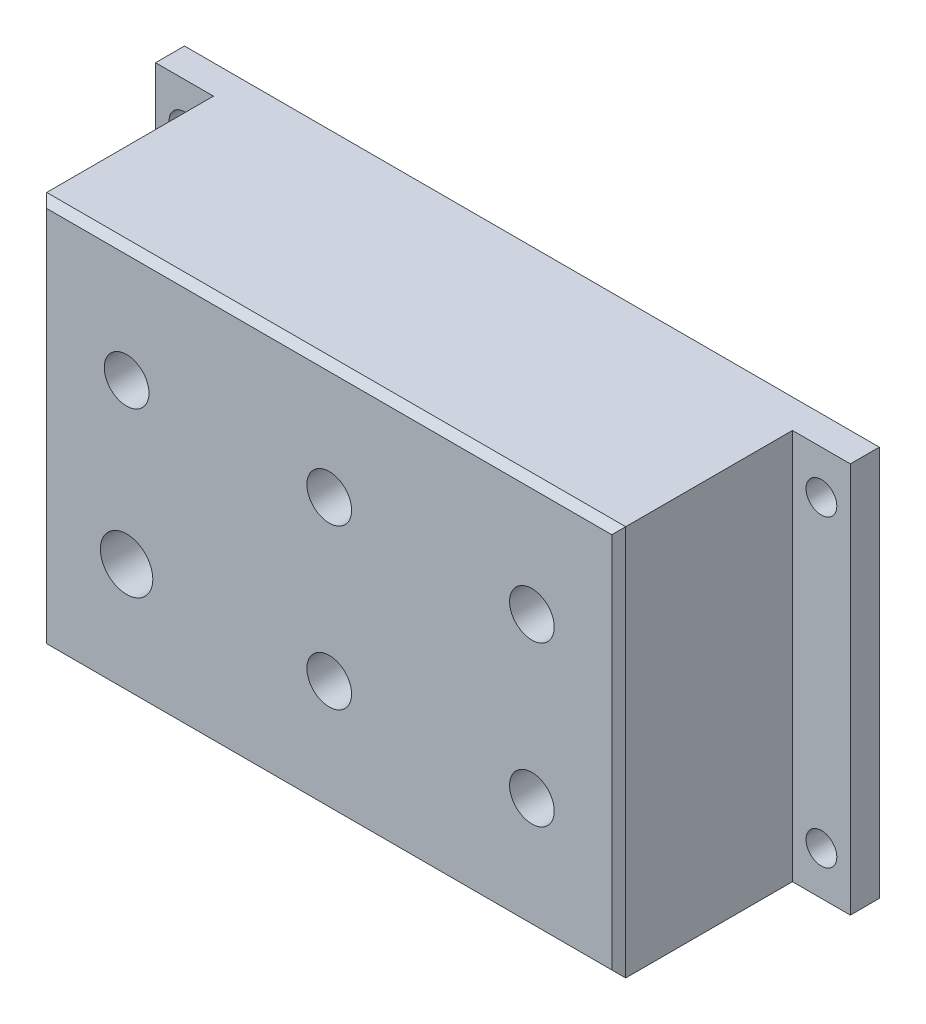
ISO-10303-21;
HEADER;
FILE_DESCRIPTION(('STEP AP214'),'2;1');
FILE_NAME('part.step','',(''),(''),'','','');
FILE_SCHEMA(('AUTOMOTIVE_DESIGN { 1 0 10303 214 1 1 1 1 }'));
ENDSEC;
DATA;
#1=APPLICATION_CONTEXT('core data for automotive mechanical design processes');
#2=APPLICATION_PROTOCOL_DEFINITION('international standard','automotive_design',2000,#1);
#3=PRODUCT_CONTEXT('',#1,'mechanical');
#4=PRODUCT('Part','Part','',(#3));
#5=PRODUCT_RELATED_PRODUCT_CATEGORY('part','',(#4));
#6=PRODUCT_DEFINITION_FORMATION('','',#4);
#7=PRODUCT_DEFINITION_CONTEXT('part definition',#1,'design');
#8=PRODUCT_DEFINITION('design','',#6,#7);
#9=PRODUCT_DEFINITION_SHAPE('','',#8);
#10=(LENGTH_UNIT() NAMED_UNIT(*) SI_UNIT(.MILLI.,.METRE.));
#11=(NAMED_UNIT(*) PLANE_ANGLE_UNIT() SI_UNIT($,.RADIAN.));
#12=(NAMED_UNIT(*) SI_UNIT($,.STERADIAN.) SOLID_ANGLE_UNIT());
#13=UNCERTAINTY_MEASURE_WITH_UNIT(LENGTH_MEASURE(1.E-05),#10,'distance_accuracy_value','');
#14=(GEOMETRIC_REPRESENTATION_CONTEXT(3) GLOBAL_UNCERTAINTY_ASSIGNED_CONTEXT((#13)) GLOBAL_UNIT_ASSIGNED_CONTEXT((#10,
#11,#12)) REPRESENTATION_CONTEXT('',''));
#15=CARTESIAN_POINT('',(0.,0.,0.));
#16=DIRECTION('',(0.,0.,1.));
#17=DIRECTION('',(1.,0.,0.));
#18=AXIS2_PLACEMENT_3D('',#15,#16,#17);
#19=CARTESIAN_POINT('',(0.,0.,44.45));
#20=DIRECTION('',(1.,0.,0.));
#21=DIRECTION('',(0.,0.,-1.));
#22=AXIS2_PLACEMENT_3D('',#19,#20,#21);
#23=PLANE('',#22);
#24=DIRECTION('',(0.,-1.,0.));
#25=VECTOR('',#24,1.);
#26=CARTESIAN_POINT('',(0.,85.725,6.34999999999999));
#27=LINE('',#26,#25);
#28=CARTESIAN_POINT('',(0.,85.725,6.34999999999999));
#29=VERTEX_POINT('',#28);
#30=CARTESIAN_POINT('',(0.,0.,6.34999999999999));
#31=VERTEX_POINT('',#30);
#32=EDGE_CURVE('E268',#29,#31,#27,.T.);
#33=ORIENTED_EDGE('',*,*,#32,.F.);
#34=DIRECTION('',(0.,0.,-1.));
#35=VECTOR('',#34,1.);
#36=CARTESIAN_POINT('',(0.,85.725,44.45));
#37=LINE('',#36,#35);
#38=CARTESIAN_POINT('',(0.,85.725,0.));
#39=VERTEX_POINT('',#38);
#40=EDGE_CURVE('E271',#29,#39,#37,.T.);
#41=ORIENTED_EDGE('',*,*,#40,.T.);
#42=DIRECTION('',(0.,-1.,0.));
#43=VECTOR('',#42,1.);
#44=CARTESIAN_POINT('',(0.,0.,0.));
#45=LINE('',#44,#43);
#46=CARTESIAN_POINT('',(0.,0.,0.));
#47=VERTEX_POINT('',#46);
#48=EDGE_CURVE('E491',#39,#47,#45,.T.);
#49=ORIENTED_EDGE('',*,*,#48,.T.);
#50=DIRECTION('',(0.,0.,-1.));
#51=VECTOR('',#50,1.);
#52=CARTESIAN_POINT('',(0.,0.,44.45));
#53=LINE('',#52,#51);
#54=EDGE_CURVE('E273',#31,#47,#53,.T.);
#55=ORIENTED_EDGE('',*,*,#54,.F.);
#56=EDGE_LOOP('',(#33,#41,#49,#55));
#57=FACE_BOUND('',#56,.T.);
#58=ADVANCED_FACE('F40',(#57),#23,.F.);
#59=CARTESIAN_POINT('',(0.,0.,44.45));
#60=DIRECTION('',(0.,1.,0.));
#61=DIRECTION('',(0.,0.,1.));
#62=AXIS2_PLACEMENT_3D('',#59,#60,#61);
#63=PLANE('',#62);
#64=DIRECTION('',(0.,0.,1.));
#65=VECTOR('',#64,1.);
#66=CARTESIAN_POINT('',(139.7,0.,6.34999999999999));
#67=LINE('',#66,#65);
#68=CARTESIAN_POINT('',(139.7,0.,6.34999999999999));
#69=VERTEX_POINT('',#68);
#70=CARTESIAN_POINT('',(139.7,0.,42.926));
#71=VERTEX_POINT('',#70);
#72=EDGE_CURVE('E278',#69,#71,#67,.T.);
#73=ORIENTED_EDGE('',*,*,#72,.T.);
#74=DIRECTION('',(-1.,0.,0.));
#75=VECTOR('',#74,1.);
#76=CARTESIAN_POINT('',(0.,0.,42.926));
#77=LINE('',#76,#75);
#78=CARTESIAN_POINT('',(12.7,0.,42.926));
#79=VERTEX_POINT('',#78);
#80=EDGE_CURVE('E311',#71,#79,#77,.T.);
#81=ORIENTED_EDGE('',*,*,#80,.T.);
#82=DIRECTION('',(0.,0.,1.));
#83=VECTOR('',#82,1.);
#84=CARTESIAN_POINT('',(12.7,0.,6.34999999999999));
#85=LINE('',#84,#83);
#86=CARTESIAN_POINT('',(12.7,0.,6.34999999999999));
#87=VERTEX_POINT('',#86);
#88=EDGE_CURVE('E488',#87,#79,#85,.T.);
#89=ORIENTED_EDGE('',*,*,#88,.F.);
#90=DIRECTION('',(1.,0.,0.));
#91=VECTOR('',#90,1.);
#92=CARTESIAN_POINT('',(0.,0.,6.34999999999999));
#93=LINE('',#92,#91);
#94=EDGE_CURVE('E277',#31,#87,#93,.T.);
#95=ORIENTED_EDGE('',*,*,#94,.F.);
#96=ORIENTED_EDGE('',*,*,#54,.T.);
#97=DIRECTION('',(1.,0.,0.));
#98=VECTOR('',#97,1.);
#99=CARTESIAN_POINT('',(0.,0.,0.));
#100=LINE('',#99,#98);
#101=CARTESIAN_POINT('',(152.4,0.,0.));
#102=VERTEX_POINT('',#101);
#103=EDGE_CURVE('E494',#47,#102,#100,.T.);
#104=ORIENTED_EDGE('',*,*,#103,.T.);
#105=DIRECTION('',(0.,0.,-1.));
#106=VECTOR('',#105,1.);
#107=CARTESIAN_POINT('',(152.4,0.,44.45));
#108=LINE('',#107,#106);
#109=CARTESIAN_POINT('',(152.4,0.,6.34999999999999));
#110=VERTEX_POINT('',#109);
#111=EDGE_CURVE('E289',#110,#102,#108,.T.);
#112=ORIENTED_EDGE('',*,*,#111,.F.);
#113=DIRECTION('',(1.,0.,0.));
#114=VECTOR('',#113,1.);
#115=CARTESIAN_POINT('',(152.4,0.,6.34999999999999));
#116=LINE('',#115,#114);
#117=EDGE_CURVE('E476',#69,#110,#116,.T.);
#118=ORIENTED_EDGE('',*,*,#117,.F.);
#119=EDGE_LOOP('',(#73,#81,#89,#95,#96,#104,#112,#118));
#120=FACE_BOUND('',#119,.T.);
#121=ADVANCED_FACE('F259',(#120),#63,.F.);
#122=CARTESIAN_POINT('',(152.4,0.,44.45));
#123=DIRECTION('',(-1.,0.,0.));
#124=DIRECTION('',(0.,0.,1.));
#125=AXIS2_PLACEMENT_3D('',#122,#123,#124);
#126=PLANE('',#125);
#127=DIRECTION('',(0.,0.,-1.));
#128=VECTOR('',#127,1.);
#129=CARTESIAN_POINT('',(152.4,85.725,44.45));
#130=LINE('',#129,#128);
#131=CARTESIAN_POINT('',(152.4,85.725,6.34999999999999));
#132=VERTEX_POINT('',#131);
#133=CARTESIAN_POINT('',(152.4,85.725,0.));
#134=VERTEX_POINT('',#133);
#135=EDGE_CURVE('E287',#132,#134,#130,.T.);
#136=ORIENTED_EDGE('',*,*,#135,.F.);
#137=DIRECTION('',(0.,1.,0.));
#138=VECTOR('',#137,1.);
#139=CARTESIAN_POINT('',(152.4,85.725,6.34999999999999));
#140=LINE('',#139,#138);
#141=EDGE_CURVE('E468',#110,#132,#140,.T.);
#142=ORIENTED_EDGE('',*,*,#141,.F.);
#143=ORIENTED_EDGE('',*,*,#111,.T.);
#144=DIRECTION('',(0.,1.,0.));
#145=VECTOR('',#144,1.);
#146=CARTESIAN_POINT('',(152.4,0.,0.));
#147=LINE('',#146,#145);
#148=EDGE_CURVE('E291',#102,#134,#147,.T.);
#149=ORIENTED_EDGE('',*,*,#148,.T.);
#150=EDGE_LOOP('',(#136,#142,#143,#149));
#151=FACE_BOUND('',#150,.T.);
#152=ADVANCED_FACE('F264',(#151),#126,.F.);
#153=CARTESIAN_POINT('',(0.,85.725,44.45));
#154=DIRECTION('',(0.,-1.,0.));
#155=DIRECTION('',(1.,0.,0.));
#156=AXIS2_PLACEMENT_3D('',#153,#154,#155);
#157=PLANE('',#156);
#158=DIRECTION('',(0.,0.,1.));
#159=VECTOR('',#158,1.);
#160=CARTESIAN_POINT('',(12.7,85.725,6.34999999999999));
#161=LINE('',#160,#159);
#162=CARTESIAN_POINT('',(12.7,85.725,6.34999999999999));
#163=VERTEX_POINT('',#162);
#164=CARTESIAN_POINT('',(12.7,85.725,42.926));
#165=VERTEX_POINT('',#164);
#166=EDGE_CURVE('E489',#163,#165,#161,.T.);
#167=ORIENTED_EDGE('',*,*,#166,.T.);
#168=DIRECTION('',(1.,0.,0.));
#169=VECTOR('',#168,1.);
#170=CARTESIAN_POINT('',(0.,85.725,42.926));
#171=LINE('',#170,#169);
#172=CARTESIAN_POINT('',(139.7,85.725,42.926));
#173=VERTEX_POINT('',#172);
#174=EDGE_CURVE('E316',#165,#173,#171,.T.);
#175=ORIENTED_EDGE('',*,*,#174,.T.);
#176=DIRECTION('',(0.,0.,1.));
#177=VECTOR('',#176,1.);
#178=CARTESIAN_POINT('',(139.7,85.725,6.34999999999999));
#179=LINE('',#178,#177);
#180=CARTESIAN_POINT('',(139.7,85.725,6.34999999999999));
#181=VERTEX_POINT('',#180);
#182=EDGE_CURVE('E478',#181,#173,#179,.T.);
#183=ORIENTED_EDGE('',*,*,#182,.F.);
#184=DIRECTION('',(-1.,0.,0.));
#185=VECTOR('',#184,1.);
#186=CARTESIAN_POINT('',(152.4,85.725,6.34999999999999));
#187=LINE('',#186,#185);
#188=EDGE_CURVE('E470',#132,#181,#187,.T.);
#189=ORIENTED_EDGE('',*,*,#188,.F.);
#190=ORIENTED_EDGE('',*,*,#135,.T.);
#191=DIRECTION('',(-1.,0.,0.));
#192=VECTOR('',#191,1.);
#193=CARTESIAN_POINT('',(0.,85.725,0.));
#194=LINE('',#193,#192);
#195=EDGE_CURVE('E285',#134,#39,#194,.T.);
#196=ORIENTED_EDGE('',*,*,#195,.T.);
#197=ORIENTED_EDGE('',*,*,#40,.F.);
#198=DIRECTION('',(-1.,0.,0.));
#199=VECTOR('',#198,1.);
#200=CARTESIAN_POINT('',(0.,85.725,6.34999999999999));
#201=LINE('',#200,#199);
#202=EDGE_CURVE('E283',#163,#29,#201,.T.);
#203=ORIENTED_EDGE('',*,*,#202,.F.);
#204=EDGE_LOOP('',(#167,#175,#183,#189,#190,#196,#197,#203));
#205=FACE_BOUND('',#204,.T.);
#206=ADVANCED_FACE('F282',(#205),#157,.F.);
#207=CARTESIAN_POINT('',(0.,0.,44.45));
#208=DIRECTION('',(0.,0.,-1.));
#209=DIRECTION('',(-1.,0.,0.));
#210=AXIS2_PLACEMENT_3D('',#207,#208,#209);
#211=PLANE('',#210);
#212=DIRECTION('',(0.,-1.,0.));
#213=VECTOR('',#212,1.);
#214=CARTESIAN_POINT('',(14.224,0.,44.45));
#215=LINE('',#214,#213);
#216=CARTESIAN_POINT('',(14.224,84.201,44.45));
#217=VERTEX_POINT('',#216);
#218=CARTESIAN_POINT('',(14.224,1.52400000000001,44.45));
#219=VERTEX_POINT('',#218);
#220=EDGE_CURVE('E297',#217,#219,#215,.T.);
#221=ORIENTED_EDGE('',*,*,#220,.T.);
#222=DIRECTION('',(1.,0.,0.));
#223=VECTOR('',#222,1.);
#224=CARTESIAN_POINT('',(0.,1.52400000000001,44.45));
#225=LINE('',#224,#223);
#226=CARTESIAN_POINT('',(138.176,1.52400000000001,44.45));
#227=VERTEX_POINT('',#226);
#228=EDGE_CURVE('E308',#219,#227,#225,.T.);
#229=ORIENTED_EDGE('',*,*,#228,.T.);
#230=DIRECTION('',(0.,1.,0.));
#231=VECTOR('',#230,1.);
#232=CARTESIAN_POINT('',(138.176,0.,44.45));
#233=LINE('',#232,#231);
#234=CARTESIAN_POINT('',(138.176,84.201,44.45));
#235=VERTEX_POINT('',#234);
#236=EDGE_CURVE('E306',#227,#235,#233,.T.);
#237=ORIENTED_EDGE('',*,*,#236,.T.);
#238=DIRECTION('',(-1.,0.,0.));
#239=VECTOR('',#238,1.);
#240=CARTESIAN_POINT('',(0.,84.201,44.45));
#241=LINE('',#240,#239);
#242=EDGE_CURVE('E304',#235,#217,#241,.T.);
#243=ORIENTED_EDGE('',*,*,#242,.T.);
#244=EDGE_LOOP('',(#221,#229,#237,#243));
#245=FACE_BOUND('',#244,.T.);
#246=CARTESIAN_POINT('',(120.65,25.4,44.45));
#247=DIRECTION('',(0.,0.,1.));
#248=DIRECTION('',(1.,0.,0.));
#249=AXIS2_PLACEMENT_3D('',#246,#247,#248);
#250=CIRCLE('',#249,4.9022);
#251=CARTESIAN_POINT('',(125.5522,25.4,44.45));
#252=VERTEX_POINT('',#251);
#253=EDGE_CURVE('E426',#252,#252,#250,.T.);
#254=ORIENTED_EDGE('',*,*,#253,.F.);
#255=EDGE_LOOP('',(#254));
#256=FACE_BOUND('',#255,.T.);
#257=CARTESIAN_POINT('',(120.65,60.325,44.45));
#258=DIRECTION('',(0.,0.,1.));
#259=DIRECTION('',(1.,0.,0.));
#260=AXIS2_PLACEMENT_3D('',#257,#258,#259);
#261=CIRCLE('',#260,4.90220000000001);
#262=CARTESIAN_POINT('',(125.5522,60.325,44.45));
#263=VERTEX_POINT('',#262);
#264=EDGE_CURVE('E429',#263,#263,#261,.T.);
#265=ORIENTED_EDGE('',*,*,#264,.F.);
#266=EDGE_LOOP('',(#265));
#267=FACE_BOUND('',#266,.T.);
#268=CARTESIAN_POINT('',(76.2,60.325,44.45));
#269=DIRECTION('',(0.,0.,1.));
#270=DIRECTION('',(1.,0.,0.));
#271=AXIS2_PLACEMENT_3D('',#268,#269,#270);
#272=CIRCLE('',#271,4.9022);
#273=CARTESIAN_POINT('',(81.1022,60.325,44.45));
#274=VERTEX_POINT('',#273);
#275=EDGE_CURVE('E432',#274,#274,#272,.T.);
#276=ORIENTED_EDGE('',*,*,#275,.F.);
#277=EDGE_LOOP('',(#276));
#278=FACE_BOUND('',#277,.T.);
#279=CARTESIAN_POINT('',(31.75,60.325,44.45));
#280=DIRECTION('',(0.,0.,1.));
#281=DIRECTION('',(1.,0.,0.));
#282=AXIS2_PLACEMENT_3D('',#279,#280,#281);
#283=CIRCLE('',#282,4.9022);
#284=CARTESIAN_POINT('',(36.6522,60.325,44.45));
#285=VERTEX_POINT('',#284);
#286=EDGE_CURVE('E435',#285,#285,#283,.T.);
#287=ORIENTED_EDGE('',*,*,#286,.F.);
#288=EDGE_LOOP('',(#287));
#289=FACE_BOUND('',#288,.T.);
#290=CARTESIAN_POINT('',(76.2,25.4,44.45));
#291=DIRECTION('',(0.,0.,1.));
#292=DIRECTION('',(1.,0.,0.));
#293=AXIS2_PLACEMENT_3D('',#290,#291,#292);
#294=CIRCLE('',#293,4.9022);
#295=CARTESIAN_POINT('',(81.1022,25.4,44.45));
#296=VERTEX_POINT('',#295);
#297=EDGE_CURVE('E438',#296,#296,#294,.T.);
#298=ORIENTED_EDGE('',*,*,#297,.F.);
#299=EDGE_LOOP('',(#298));
#300=FACE_BOUND('',#299,.T.);
#301=CARTESIAN_POINT('',(31.75,25.4,44.45));
#302=DIRECTION('',(0.,0.,1.));
#303=DIRECTION('',(1.,0.,0.));
#304=AXIS2_PLACEMENT_3D('',#301,#302,#303);
#305=CIRCLE('',#304,5.7531);
#306=CARTESIAN_POINT('',(37.5031,25.4,44.45));
#307=VERTEX_POINT('',#306);
#308=EDGE_CURVE('E441',#307,#307,#305,.T.);
#309=ORIENTED_EDGE('',*,*,#308,.F.);
#310=EDGE_LOOP('',(#309));
#311=FACE_BOUND('',#310,.T.);
#312=ADVANCED_FACE('F518',(#245,#256,#267,#278,#289,#300,#311),#211,.F.);
#313=CARTESIAN_POINT('',(0.,0.,0.));
#314=DIRECTION('',(0.,0.,-1.));
#315=DIRECTION('',(-1.,0.,0.));
#316=AXIS2_PLACEMENT_3D('',#313,#314,#315);
#317=PLANE('',#316);
#318=CARTESIAN_POINT('',(127.,73.025,0.));
#319=DIRECTION('',(0.,0.,-1.));
#320=DIRECTION('',(1.,0.,0.));
#321=AXIS2_PLACEMENT_3D('',#318,#319,#320);
#322=CIRCLE('',#321,6.34999999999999);
#323=CARTESIAN_POINT('',(127.,79.375,0.));
#324=VERTEX_POINT('',#323);
#325=CARTESIAN_POINT('',(133.35,73.025,0.));
#326=VERTEX_POINT('',#325);
#327=EDGE_CURVE('E349',#324,#326,#322,.T.);
#328=ORIENTED_EDGE('',*,*,#327,.F.);
#329=DIRECTION('',(1.,0.,0.));
#330=VECTOR('',#329,1.);
#331=CARTESIAN_POINT('',(127.,79.375,0.));
#332=LINE('',#331,#330);
#333=CARTESIAN_POINT('',(25.4,79.375,0.));
#334=VERTEX_POINT('',#333);
#335=EDGE_CURVE('E369',#334,#324,#332,.T.);
#336=ORIENTED_EDGE('',*,*,#335,.F.);
#337=CARTESIAN_POINT('',(25.4,73.025,0.));
#338=DIRECTION('',(0.,0.,-1.));
#339=DIRECTION('',(-1.,0.,0.));
#340=AXIS2_PLACEMENT_3D('',#337,#338,#339);
#341=CIRCLE('',#340,6.34999999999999);
#342=CARTESIAN_POINT('',(19.05,73.025,0.));
#343=VERTEX_POINT('',#342);
#344=EDGE_CURVE('E366',#343,#334,#341,.T.);
#345=ORIENTED_EDGE('',*,*,#344,.F.);
#346=DIRECTION('',(0.,1.,0.));
#347=VECTOR('',#346,1.);
#348=CARTESIAN_POINT('',(19.05,73.025,0.));
#349=LINE('',#348,#347);
#350=CARTESIAN_POINT('',(19.05,12.7,0.));
#351=VERTEX_POINT('',#350);
#352=EDGE_CURVE('E363',#351,#343,#349,.T.);
#353=ORIENTED_EDGE('',*,*,#352,.F.);
#354=CARTESIAN_POINT('',(25.4,12.7,0.));
#355=DIRECTION('',(0.,0.,-1.));
#356=DIRECTION('',(-1.,0.,0.));
#357=AXIS2_PLACEMENT_3D('',#354,#355,#356);
#358=CIRCLE('',#357,6.35);
#359=CARTESIAN_POINT('',(25.4,6.35,0.));
#360=VERTEX_POINT('',#359);
#361=EDGE_CURVE('E360',#360,#351,#358,.T.);
#362=ORIENTED_EDGE('',*,*,#361,.F.);
#363=DIRECTION('',(-1.,0.,0.));
#364=VECTOR('',#363,1.);
#365=CARTESIAN_POINT('',(127.,6.35,0.));
#366=LINE('',#365,#364);
#367=CARTESIAN_POINT('',(127.,6.35,0.));
#368=VERTEX_POINT('',#367);
#369=EDGE_CURVE('E357',#368,#360,#366,.T.);
#370=ORIENTED_EDGE('',*,*,#369,.F.);
#371=CARTESIAN_POINT('',(127.,12.7,0.));
#372=DIRECTION('',(0.,0.,-1.));
#373=DIRECTION('',(1.,0.,0.));
#374=AXIS2_PLACEMENT_3D('',#371,#372,#373);
#375=CIRCLE('',#374,6.35);
#376=CARTESIAN_POINT('',(133.35,12.7,0.));
#377=VERTEX_POINT('',#376);
#378=EDGE_CURVE('E354',#377,#368,#375,.T.);
#379=ORIENTED_EDGE('',*,*,#378,.F.);
#380=DIRECTION('',(0.,-1.,0.));
#381=VECTOR('',#380,1.);
#382=CARTESIAN_POINT('',(133.35,73.025,0.));
#383=LINE('',#382,#381);
#384=EDGE_CURVE('E351',#326,#377,#383,.T.);
#385=ORIENTED_EDGE('',*,*,#384,.F.);
#386=EDGE_LOOP('',(#328,#336,#345,#353,#362,#370,#379,#385));
#387=FACE_BOUND('',#386,.T.);
#388=CARTESIAN_POINT('',(146.05,76.2,0.));
#389=DIRECTION('',(0.,0.,1.));
#390=DIRECTION('',(1.,0.,0.));
#391=AXIS2_PLACEMENT_3D('',#388,#389,#390);
#392=CIRCLE('',#391,3.37819999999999);
#393=CARTESIAN_POINT('',(149.4282,76.2,0.));
#394=VERTEX_POINT('',#393);
#395=EDGE_CURVE('E447',#394,#394,#392,.T.);
#396=ORIENTED_EDGE('',*,*,#395,.T.);
#397=EDGE_LOOP('',(#396));
#398=FACE_BOUND('',#397,.T.);
#399=CARTESIAN_POINT('',(146.05,9.52499999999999,0.));
#400=DIRECTION('',(0.,0.,1.));
#401=DIRECTION('',(1.,0.,0.));
#402=AXIS2_PLACEMENT_3D('',#399,#400,#401);
#403=CIRCLE('',#402,3.37819999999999);
#404=CARTESIAN_POINT('',(149.4282,9.52499999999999,0.));
#405=VERTEX_POINT('',#404);
#406=EDGE_CURVE('E453',#405,#405,#403,.T.);
#407=ORIENTED_EDGE('',*,*,#406,.T.);
#408=EDGE_LOOP('',(#407));
#409=FACE_BOUND('',#408,.T.);
#410=CARTESIAN_POINT('',(6.35000000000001,9.52499999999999,0.));
#411=DIRECTION('',(0.,0.,1.));
#412=DIRECTION('',(1.,0.,0.));
#413=AXIS2_PLACEMENT_3D('',#410,#411,#412);
#414=CIRCLE('',#413,3.3782);
#415=CARTESIAN_POINT('',(9.72820000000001,9.52499999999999,0.));
#416=VERTEX_POINT('',#415);
#417=EDGE_CURVE('E459',#416,#416,#414,.T.);
#418=ORIENTED_EDGE('',*,*,#417,.T.);
#419=EDGE_LOOP('',(#418));
#420=FACE_BOUND('',#419,.T.);
#421=CARTESIAN_POINT('',(6.35,76.2,0.));
#422=DIRECTION('',(0.,0.,1.));
#423=DIRECTION('',(1.,0.,0.));
#424=AXIS2_PLACEMENT_3D('',#421,#422,#423);
#425=CIRCLE('',#424,3.3782);
#426=CARTESIAN_POINT('',(9.7282,76.2,0.));
#427=VERTEX_POINT('',#426);
#428=EDGE_CURVE('E465',#427,#427,#425,.T.);
#429=ORIENTED_EDGE('',*,*,#428,.T.);
#430=EDGE_LOOP('',(#429));
#431=FACE_BOUND('',#430,.T.);
#432=ORIENTED_EDGE('',*,*,#48,.F.);
#433=ORIENTED_EDGE('',*,*,#195,.F.);
#434=ORIENTED_EDGE('',*,*,#148,.F.);
#435=ORIENTED_EDGE('',*,*,#103,.F.);
#436=EDGE_LOOP('',(#432,#433,#434,#435));
#437=FACE_BOUND('',#436,.T.);
#438=ADVANCED_FACE('F504',(#387,#398,#409,#420,#431,#437),#317,.T.);
#439=CARTESIAN_POINT('',(12.7,85.725,6.34999999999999));
#440=DIRECTION('',(1.,0.,0.));
#441=DIRECTION('',(0.,1.,0.));
#442=AXIS2_PLACEMENT_3D('',#439,#440,#441);
#443=PLANE('',#442);
#444=CARTESIAN_POINT('',(12.7,42.8625,21.844));
#445=DIRECTION('',(-1.,0.,0.));
#446=DIRECTION('',(0.,0.,1.));
#447=AXIS2_PLACEMENT_3D('',#444,#445,#446);
#448=CIRCLE('',#447,9.8827971);
#449=CARTESIAN_POINT('',(12.7,42.8625,31.7267971));
#450=VERTEX_POINT('',#449);
#451=EDGE_CURVE('E207',#450,#450,#448,.T.);
#452=ORIENTED_EDGE('',*,*,#451,.F.);
#453=EDGE_LOOP('',(#452));
#454=FACE_BOUND('',#453,.T.);
#455=ORIENTED_EDGE('',*,*,#88,.T.);
#456=DIRECTION('',(0.,1.,0.));
#457=VECTOR('',#456,1.);
#458=CARTESIAN_POINT('',(12.7,85.725,42.926));
#459=LINE('',#458,#457);
#460=EDGE_CURVE('E67',#79,#165,#459,.T.);
#461=ORIENTED_EDGE('',*,*,#460,.T.);
#462=ORIENTED_EDGE('',*,*,#166,.F.);
#463=DIRECTION('',(0.,1.,0.));
#464=VECTOR('',#463,1.);
#465=CARTESIAN_POINT('',(12.7,85.725,6.34999999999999));
#466=LINE('',#465,#464);
#467=EDGE_CURVE('E484',#87,#163,#466,.T.);
#468=ORIENTED_EDGE('',*,*,#467,.F.);
#469=EDGE_LOOP('',(#455,#461,#462,#468));
#470=FACE_BOUND('',#469,.T.);
#471=ADVANCED_FACE('F508',(#454,#470),#443,.F.);
#472=CARTESIAN_POINT('',(0.,0.,6.34999999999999));
#473=DIRECTION('',(0.,0.,1.));
#474=DIRECTION('',(1.,0.,0.));
#475=AXIS2_PLACEMENT_3D('',#472,#473,#474);
#476=PLANE('',#475);
#477=CARTESIAN_POINT('',(6.35000000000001,9.52499999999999,6.34999999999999));
#478=DIRECTION('',(0.,0.,1.));
#479=DIRECTION('',(1.,0.,0.));
#480=AXIS2_PLACEMENT_3D('',#477,#478,#479);
#481=CIRCLE('',#480,3.3782);
#482=CARTESIAN_POINT('',(9.72820000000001,9.52499999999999,6.34999999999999));
#483=VERTEX_POINT('',#482);
#484=EDGE_CURVE('E456',#483,#483,#481,.T.);
#485=ORIENTED_EDGE('',*,*,#484,.F.);
#486=EDGE_LOOP('',(#485));
#487=FACE_BOUND('',#486,.T.);
#488=CARTESIAN_POINT('',(6.35,76.2,6.34999999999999));
#489=DIRECTION('',(0.,0.,1.));
#490=DIRECTION('',(1.,0.,0.));
#491=AXIS2_PLACEMENT_3D('',#488,#489,#490);
#492=CIRCLE('',#491,3.3782);
#493=CARTESIAN_POINT('',(9.7282,76.2,6.34999999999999));
#494=VERTEX_POINT('',#493);
#495=EDGE_CURVE('E462',#494,#494,#492,.T.);
#496=ORIENTED_EDGE('',*,*,#495,.F.);
#497=EDGE_LOOP('',(#496));
#498=FACE_BOUND('',#497,.T.);
#499=ORIENTED_EDGE('',*,*,#32,.T.);
#500=ORIENTED_EDGE('',*,*,#94,.T.);
#501=ORIENTED_EDGE('',*,*,#467,.T.);
#502=ORIENTED_EDGE('',*,*,#202,.T.);
#503=EDGE_LOOP('',(#499,#500,#501,#502));
#504=FACE_BOUND('',#503,.T.);
#505=ADVANCED_FACE('F507',(#487,#498,#504),#476,.T.);
#506=CARTESIAN_POINT('',(139.7,85.725,6.34999999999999));
#507=DIRECTION('',(-1.,0.,0.));
#508=DIRECTION('',(0.,0.,1.));
#509=AXIS2_PLACEMENT_3D('',#506,#507,#508);
#510=PLANE('',#509);
#511=ORIENTED_EDGE('',*,*,#182,.T.);
#512=DIRECTION('',(0.,-1.,0.));
#513=VECTOR('',#512,1.);
#514=CARTESIAN_POINT('',(139.7,85.725,42.926));
#515=LINE('',#514,#513);
#516=EDGE_CURVE('E314',#173,#71,#515,.T.);
#517=ORIENTED_EDGE('',*,*,#516,.T.);
#518=ORIENTED_EDGE('',*,*,#72,.F.);
#519=DIRECTION('',(0.,-1.,0.));
#520=VECTOR('',#519,1.);
#521=CARTESIAN_POINT('',(139.7,85.725,6.34999999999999));
#522=LINE('',#521,#520);
#523=EDGE_CURVE('E473',#181,#69,#522,.T.);
#524=ORIENTED_EDGE('',*,*,#523,.F.);
#525=EDGE_LOOP('',(#511,#517,#518,#524));
#526=FACE_BOUND('',#525,.T.);
#527=ADVANCED_FACE('F523',(#526),#510,.F.);
#528=CARTESIAN_POINT('',(152.4,0.,6.34999999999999));
#529=DIRECTION('',(0.,0.,-1.));
#530=DIRECTION('',(-1.,0.,0.));
#531=AXIS2_PLACEMENT_3D('',#528,#529,#530);
#532=PLANE('',#531);
#533=CARTESIAN_POINT('',(146.05,76.2,6.34999999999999));
#534=DIRECTION('',(0.,0.,1.));
#535=DIRECTION('',(1.,0.,0.));
#536=AXIS2_PLACEMENT_3D('',#533,#534,#535);
#537=CIRCLE('',#536,3.37819999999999);
#538=CARTESIAN_POINT('',(149.4282,76.2,6.34999999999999));
#539=VERTEX_POINT('',#538);
#540=EDGE_CURVE('E444',#539,#539,#537,.T.);
#541=ORIENTED_EDGE('',*,*,#540,.F.);
#542=EDGE_LOOP('',(#541));
#543=FACE_BOUND('',#542,.T.);
#544=CARTESIAN_POINT('',(146.05,9.52499999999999,6.34999999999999));
#545=DIRECTION('',(0.,0.,1.));
#546=DIRECTION('',(1.,0.,0.));
#547=AXIS2_PLACEMENT_3D('',#544,#545,#546);
#548=CIRCLE('',#547,3.37819999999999);
#549=CARTESIAN_POINT('',(149.4282,9.52499999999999,6.34999999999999));
#550=VERTEX_POINT('',#549);
#551=EDGE_CURVE('E450',#550,#550,#548,.T.);
#552=ORIENTED_EDGE('',*,*,#551,.F.);
#553=EDGE_LOOP('',(#552));
#554=FACE_BOUND('',#553,.T.);
#555=ORIENTED_EDGE('',*,*,#141,.T.);
#556=ORIENTED_EDGE('',*,*,#188,.T.);
#557=ORIENTED_EDGE('',*,*,#523,.T.);
#558=ORIENTED_EDGE('',*,*,#117,.T.);
#559=EDGE_LOOP('',(#555,#556,#557,#558));
#560=FACE_BOUND('',#559,.T.);
#561=ADVANCED_FACE('F526',(#543,#554,#560),#532,.F.);
#562=CARTESIAN_POINT('',(6.35,76.2,0.));
#563=DIRECTION('',(0.,0.,1.));
#564=DIRECTION('',(1.,0.,0.));
#565=AXIS2_PLACEMENT_3D('',#562,#563,#564);
#566=CYLINDRICAL_SURFACE('',#565,3.3782);
#567=ORIENTED_EDGE('',*,*,#428,.F.);
#568=EDGE_LOOP('',(#567));
#569=FACE_BOUND('',#568,.T.);
#570=ORIENTED_EDGE('',*,*,#495,.T.);
#571=EDGE_LOOP('',(#570));
#572=FACE_BOUND('',#571,.T.);
#573=ADVANCED_FACE('F529',(#569,#572),#566,.F.);
#574=CARTESIAN_POINT('',(6.35000000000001,9.52499999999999,0.));
#575=DIRECTION('',(0.,0.,1.));
#576=DIRECTION('',(1.,0.,0.));
#577=AXIS2_PLACEMENT_3D('',#574,#575,#576);
#578=CYLINDRICAL_SURFACE('',#577,3.3782);
#579=ORIENTED_EDGE('',*,*,#417,.F.);
#580=EDGE_LOOP('',(#579));
#581=FACE_BOUND('',#580,.T.);
#582=ORIENTED_EDGE('',*,*,#484,.T.);
#583=EDGE_LOOP('',(#582));
#584=FACE_BOUND('',#583,.T.);
#585=ADVANCED_FACE('F536',(#581,#584),#578,.F.);
#586=CARTESIAN_POINT('',(146.05,9.52499999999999,0.));
#587=DIRECTION('',(0.,0.,1.));
#588=DIRECTION('',(1.,0.,0.));
#589=AXIS2_PLACEMENT_3D('',#586,#587,#588);
#590=CYLINDRICAL_SURFACE('',#589,3.37819999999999);
#591=ORIENTED_EDGE('',*,*,#406,.F.);
#592=EDGE_LOOP('',(#591));
#593=FACE_BOUND('',#592,.T.);
#594=ORIENTED_EDGE('',*,*,#551,.T.);
#595=EDGE_LOOP('',(#594));
#596=FACE_BOUND('',#595,.T.);
#597=ADVANCED_FACE('F777',(#593,#596),#590,.F.);
#598=CARTESIAN_POINT('',(146.05,76.2,0.));
#599=DIRECTION('',(0.,0.,1.));
#600=DIRECTION('',(1.,0.,0.));
#601=AXIS2_PLACEMENT_3D('',#598,#599,#600);
#602=CYLINDRICAL_SURFACE('',#601,3.37819999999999);
#603=ORIENTED_EDGE('',*,*,#395,.F.);
#604=EDGE_LOOP('',(#603));
#605=FACE_BOUND('',#604,.T.);
#606=ORIENTED_EDGE('',*,*,#540,.T.);
#607=EDGE_LOOP('',(#606));
#608=FACE_BOUND('',#607,.T.);
#609=ADVANCED_FACE('F773',(#605,#608),#602,.F.);
#610=CARTESIAN_POINT('',(31.75,25.4,0.));
#611=DIRECTION('',(0.,0.,1.));
#612=DIRECTION('',(1.,0.,0.));
#613=AXIS2_PLACEMENT_3D('',#610,#611,#612);
#614=CYLINDRICAL_SURFACE('',#613,5.7531);
#615=CARTESIAN_POINT('',(31.75,25.4,28.575));
#616=DIRECTION('',(0.,0.,1.));
#617=DIRECTION('',(1.,0.,0.));
#618=AXIS2_PLACEMENT_3D('',#615,#616,#617);
#619=CIRCLE('',#618,5.7531);
#620=CARTESIAN_POINT('',(37.5031,25.4,28.575));
#621=VERTEX_POINT('',#620);
#622=EDGE_CURVE('E423',#621,#621,#619,.F.);
#623=ORIENTED_EDGE('',*,*,#622,.T.);
#624=EDGE_LOOP('',(#623));
#625=FACE_BOUND('',#624,.T.);
#626=ORIENTED_EDGE('',*,*,#308,.T.);
#627=EDGE_LOOP('',(#626));
#628=FACE_BOUND('',#627,.T.);
#629=ADVANCED_FACE('F769',(#625,#628),#614,.F.);
#630=CARTESIAN_POINT('',(76.2,25.4,0.));
#631=DIRECTION('',(0.,0.,1.));
#632=DIRECTION('',(1.,0.,0.));
#633=AXIS2_PLACEMENT_3D('',#630,#631,#632);
#634=CYLINDRICAL_SURFACE('',#633,4.9022);
#635=CARTESIAN_POINT('',(76.2,25.4,28.575));
#636=DIRECTION('',(0.,0.,1.));
#637=DIRECTION('',(1.,0.,0.));
#638=AXIS2_PLACEMENT_3D('',#635,#636,#637);
#639=CIRCLE('',#638,4.9022);
#640=CARTESIAN_POINT('',(81.1022,25.4,28.575));
#641=VERTEX_POINT('',#640);
#642=EDGE_CURVE('E420',#641,#641,#639,.F.);
#643=ORIENTED_EDGE('',*,*,#642,.T.);
#644=EDGE_LOOP('',(#643));
#645=FACE_BOUND('',#644,.T.);
#646=ORIENTED_EDGE('',*,*,#297,.T.);
#647=EDGE_LOOP('',(#646));
#648=FACE_BOUND('',#647,.T.);
#649=ADVANCED_FACE('F765',(#645,#648),#634,.F.);
#650=CARTESIAN_POINT('',(31.75,60.325,0.));
#651=DIRECTION('',(0.,0.,1.));
#652=DIRECTION('',(1.,0.,0.));
#653=AXIS2_PLACEMENT_3D('',#650,#651,#652);
#654=CYLINDRICAL_SURFACE('',#653,4.9022);
#655=CARTESIAN_POINT('',(31.75,60.325,28.575));
#656=DIRECTION('',(0.,0.,1.));
#657=DIRECTION('',(1.,0.,0.));
#658=AXIS2_PLACEMENT_3D('',#655,#656,#657);
#659=CIRCLE('',#658,4.9022);
#660=CARTESIAN_POINT('',(36.6522,60.325,28.575));
#661=VERTEX_POINT('',#660);
#662=EDGE_CURVE('E417',#661,#661,#659,.F.);
#663=ORIENTED_EDGE('',*,*,#662,.T.);
#664=EDGE_LOOP('',(#663));
#665=FACE_BOUND('',#664,.T.);
#666=ORIENTED_EDGE('',*,*,#286,.T.);
#667=EDGE_LOOP('',(#666));
#668=FACE_BOUND('',#667,.T.);
#669=ADVANCED_FACE('F761',(#665,#668),#654,.F.);
#670=CARTESIAN_POINT('',(76.2,60.325,0.));
#671=DIRECTION('',(0.,0.,1.));
#672=DIRECTION('',(1.,0.,0.));
#673=AXIS2_PLACEMENT_3D('',#670,#671,#672);
#674=CYLINDRICAL_SURFACE('',#673,4.9022);
#675=CARTESIAN_POINT('',(76.2,60.325,28.575));
#676=DIRECTION('',(0.,0.,1.));
#677=DIRECTION('',(1.,0.,0.));
#678=AXIS2_PLACEMENT_3D('',#675,#676,#677);
#679=CIRCLE('',#678,4.9022);
#680=CARTESIAN_POINT('',(81.1022,60.325,28.575));
#681=VERTEX_POINT('',#680);
#682=EDGE_CURVE('E414',#681,#681,#679,.F.);
#683=ORIENTED_EDGE('',*,*,#682,.T.);
#684=EDGE_LOOP('',(#683));
#685=FACE_BOUND('',#684,.T.);
#686=ORIENTED_EDGE('',*,*,#275,.T.);
#687=EDGE_LOOP('',(#686));
#688=FACE_BOUND('',#687,.T.);
#689=ADVANCED_FACE('F757',(#685,#688),#674,.F.);
#690=CARTESIAN_POINT('',(120.65,60.325,0.));
#691=DIRECTION('',(0.,0.,1.));
#692=DIRECTION('',(1.,0.,0.));
#693=AXIS2_PLACEMENT_3D('',#690,#691,#692);
#694=CYLINDRICAL_SURFACE('',#693,4.90220000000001);
#695=CARTESIAN_POINT('',(120.65,60.325,28.575));
#696=DIRECTION('',(0.,0.,1.));
#697=DIRECTION('',(1.,0.,0.));
#698=AXIS2_PLACEMENT_3D('',#695,#696,#697);
#699=CIRCLE('',#698,4.90220000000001);
#700=CARTESIAN_POINT('',(125.5522,60.325,28.575));
#701=VERTEX_POINT('',#700);
#702=EDGE_CURVE('E301',#701,#701,#699,.F.);
#703=ORIENTED_EDGE('',*,*,#702,.T.);
#704=EDGE_LOOP('',(#703));
#705=FACE_BOUND('',#704,.T.);
#706=ORIENTED_EDGE('',*,*,#264,.T.);
#707=EDGE_LOOP('',(#706));
#708=FACE_BOUND('',#707,.T.);
#709=ADVANCED_FACE('F754',(#705,#708),#694,.F.);
#710=CARTESIAN_POINT('',(120.65,25.4,0.));
#711=DIRECTION('',(0.,0.,1.));
#712=DIRECTION('',(1.,0.,0.));
#713=AXIS2_PLACEMENT_3D('',#710,#711,#712);
#714=CYLINDRICAL_SURFACE('',#713,4.9022);
#715=CARTESIAN_POINT('',(120.65,25.4,28.575));
#716=DIRECTION('',(0.,0.,1.));
#717=DIRECTION('',(1.,0.,0.));
#718=AXIS2_PLACEMENT_3D('',#715,#716,#717);
#719=CIRCLE('',#718,4.9022);
#720=CARTESIAN_POINT('',(125.5522,25.4,28.575));
#721=VERTEX_POINT('',#720);
#722=EDGE_CURVE('E298',#721,#721,#719,.F.);
#723=ORIENTED_EDGE('',*,*,#722,.T.);
#724=EDGE_LOOP('',(#723));
#725=FACE_BOUND('',#724,.T.);
#726=ORIENTED_EDGE('',*,*,#253,.T.);
#727=EDGE_LOOP('',(#726));
#728=FACE_BOUND('',#727,.T.);
#729=ADVANCED_FACE('F670',(#725,#728),#714,.F.);
#730=CARTESIAN_POINT('',(127.,73.025,28.575));
#731=DIRECTION('',(0.,0.,1.));
#732=DIRECTION('',(1.,0.,0.));
#733=AXIS2_PLACEMENT_3D('',#730,#731,#732);
#734=PLANE('',#733);
#735=ORIENTED_EDGE('',*,*,#642,.F.);
#736=EDGE_LOOP('',(#735));
#737=FACE_BOUND('',#736,.T.);
#738=ORIENTED_EDGE('',*,*,#682,.F.);
#739=EDGE_LOOP('',(#738));
#740=FACE_BOUND('',#739,.T.);
#741=ORIENTED_EDGE('',*,*,#722,.F.);
#742=EDGE_LOOP('',(#741));
#743=FACE_BOUND('',#742,.T.);
#744=DIRECTION('',(0.,1.,0.));
#745=VECTOR('',#744,1.);
#746=CARTESIAN_POINT('',(19.05,73.025,28.575));
#747=LINE('',#746,#745);
#748=CARTESIAN_POINT('',(19.05,12.7,28.575));
#749=VERTEX_POINT('',#748);
#750=CARTESIAN_POINT('',(19.05,35.8881553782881,28.575));
#751=VERTEX_POINT('',#750);
#752=EDGE_CURVE('E388',#749,#751,#747,.T.);
#753=ORIENTED_EDGE('',*,*,#752,.T.);
#754=CARTESIAN_POINT('',(3.98127536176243,35.2736081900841,28.575));
#755=CARTESIAN_POINT('',(7.0815729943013,35.3977050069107,28.575));
#756=CARTESIAN_POINT('',(10.1818189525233,35.5231045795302,28.575));
#757=CARTESIAN_POINT('',(16.3821782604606,35.7770294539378,28.575));
#758=CARTESIAN_POINT('',(19.4822916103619,35.9055547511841,28.575));
#759=CARTESIAN_POINT('',(25.6823668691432,36.1662517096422,28.575));
#760=CARTESIAN_POINT('',(28.7823287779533,36.2984233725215,28.575));
#761=CARTESIAN_POINT('',(34.9820654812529,36.5671831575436,28.575));
#762=CARTESIAN_POINT('',(38.0818402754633,36.7037712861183,28.575));
#763=CARTESIAN_POINT('',(41.1814998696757,36.8429525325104,28.575));
#764=B_SPLINE_CURVE_WITH_KNOTS('',3,(#754,#755,#756,#757,#758,#759,#760,#761,#762,#763),
.UNSPECIFIED.,.F.,.F.,(4,2,2,2,4),(0.,9.30834121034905,18.6166688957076,27.9250008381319,
37.2333463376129),.UNSPECIFIED.);
#765=CARTESIAN_POINT('',(26.162,36.1872577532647,28.575));
#766=VERTEX_POINT('',#765);
#767=EDGE_CURVE('E11',#751,#766,#764,.T.);
#768=ORIENTED_EDGE('',*,*,#767,.T.);
#769=DIRECTION('',(0.,1.,0.));
#770=VECTOR('',#769,1.);
#771=CARTESIAN_POINT('',(26.162,73.025,28.575));
#772=LINE('',#771,#770);
#773=CARTESIAN_POINT('',(26.162,36.9969558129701,28.575));
#774=VERTEX_POINT('',#773);
#775=EDGE_CURVE('E52',#766,#774,#772,.T.);
#776=ORIENTED_EDGE('',*,*,#775,.T.);
#777=DIRECTION('',(-1.,0.,0.));
#778=VECTOR('',#777,1.);
#779=CARTESIAN_POINT('',(12.7,36.9969558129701,28.575));
#780=LINE('',#779,#778);
#781=CARTESIAN_POINT('',(35.306,36.9969558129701,28.575));
#782=VERTEX_POINT('',#781);
#783=EDGE_CURVE('E218',#774,#782,#780,.F.);
#784=ORIENTED_EDGE('',*,*,#783,.T.);
#785=CARTESIAN_POINT('',(13.5880051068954,-1.70498985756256,28.575));
#786=CARTESIAN_POINT('',(14.3587719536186,-0.407608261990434,28.575));
#787=CARTESIAN_POINT('',(15.1290364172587,0.890072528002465,28.575));
#788=CARTESIAN_POINT('',(16.66848026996,3.48694597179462,28.575));
#789=CARTESIAN_POINT('',(17.4376589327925,4.78613905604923,28.575));
#790=CARTESIAN_POINT('',(18.9811018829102,7.39753554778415,28.575));
#791=CARTESIAN_POINT('',(19.7553484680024,8.70974942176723,28.575));
#792=CARTESIAN_POINT('',(21.3007254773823,11.3351433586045,28.575));
#793=CARTESIAN_POINT('',(22.0718572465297,12.648322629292,28.575));
#794=CARTESIAN_POINT('',(23.4100861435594,14.9351273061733,28.575));
#795=CARTESIAN_POINT('',(23.9780814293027,15.9082268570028,28.575));
#796=CARTESIAN_POINT('',(25.1111347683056,17.8561994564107,28.575));
#797=CARTESIAN_POINT('',(25.6761926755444,18.8310725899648,28.575));
#798=CARTESIAN_POINT('',(26.8031591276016,20.7849351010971,28.575));
#799=CARTESIAN_POINT('',(27.3650603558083,21.7639287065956,28.575));
#800=CARTESIAN_POINT('',(28.2032573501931,23.2349534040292,28.575));
#801=CARTESIAN_POINT('',(28.481855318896,23.7256724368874,28.575));
#802=CARTESIAN_POINT('',(29.0371401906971,24.7081901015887,28.575));
#803=CARTESIAN_POINT('',(29.3138270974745,25.1999887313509,28.575));
#804=CARTESIAN_POINT('',(29.8627651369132,26.1812666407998,28.575));
#805=CARTESIAN_POINT('',(30.1350339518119,26.6707360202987,28.575));
#806=CARTESIAN_POINT('',(30.6765777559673,27.6513379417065,28.575));
#807=CARTESIAN_POINT('',(30.9458527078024,28.1424705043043,28.575));
#808=CARTESIAN_POINT('',(31.480715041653,29.1272144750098,28.575));
#809=CARTESIAN_POINT('',(31.7462995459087,29.6208274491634,28.575));
#810=CARTESIAN_POINT('',(32.272294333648,30.6107826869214,28.575));
#811=CARTESIAN_POINT('',(32.5327048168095,31.1071248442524,28.575));
#812=CARTESIAN_POINT('',(33.045651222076,32.1017516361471,28.575));
#813=CARTESIAN_POINT('',(33.2982108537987,32.6000239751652,28.575));
#814=CARTESIAN_POINT('',(33.6697362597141,33.3511138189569,28.575));
#815=CARTESIAN_POINT('',(33.7923710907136,33.6021162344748,28.575));
#816=CARTESIAN_POINT('',(34.034692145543,34.1055386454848,28.575));
#817=CARTESIAN_POINT('',(34.1543784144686,34.357958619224,28.575));
#818=CARTESIAN_POINT('',(34.3900486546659,34.8641294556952,28.575));
#819=CARTESIAN_POINT('',(34.5060371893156,35.1178781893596,28.575));
#820=CARTESIAN_POINT('',(34.7337105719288,35.6273151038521,28.575));
#821=CARTESIAN_POINT('',(34.8453952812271,35.8830033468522,28.575));
#822=CARTESIAN_POINT('',(35.0634455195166,36.3965332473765,28.575));
#823=CARTESIAN_POINT('',(35.1698129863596,36.6543740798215,28.575));
#824=CARTESIAN_POINT('',(35.3760381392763,37.1726370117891,28.575));
#825=CARTESIAN_POINT('',(35.4758964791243,37.4330588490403,28.575));
#826=CARTESIAN_POINT('',(35.6052986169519,37.7867202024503,28.575));
#827=CARTESIAN_POINT('',(35.6383810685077,37.8786701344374,28.575));
#828=CARTESIAN_POINT('',(35.7034774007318,38.0629530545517,28.575));
#829=CARTESIAN_POINT('',(35.7354912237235,38.1552860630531,28.575));
#830=CARTESIAN_POINT('',(35.8298117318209,38.4328930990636,28.575));
#831=CARTESIAN_POINT('',(35.8903915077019,38.6187589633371,28.575));
#832=CARTESIAN_POINT('',(36.0061966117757,38.992112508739,28.575));
#833=CARTESIAN_POINT('',(36.061423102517,39.1795998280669,28.575));
#834=CARTESIAN_POINT('',(36.1657137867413,39.556290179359,28.575));
#835=CARTESIAN_POINT('',(36.2147780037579,39.7454932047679,28.575));
#836=CARTESIAN_POINT('',(36.3045063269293,40.1199747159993,28.575));
#837=CARTESIAN_POINT('',(36.3453760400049,40.3052036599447,28.575));
#838=CARTESIAN_POINT('',(36.419637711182,40.677158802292,28.575));
#839=CARTESIAN_POINT('',(36.4530299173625,40.8638849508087,28.575));
#840=CARTESIAN_POINT('',(36.5115441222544,41.23866919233,28.575));
#841=CARTESIAN_POINT('',(36.5366648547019,41.4267274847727,28.575));
#842=CARTESIAN_POINT('',(36.5779467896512,41.803823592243,28.575));
#843=CARTESIAN_POINT('',(36.5941083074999,41.9928613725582,28.575));
#844=CARTESIAN_POINT('',(36.619033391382,42.4054528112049,28.575));
#845=CARTESIAN_POINT('',(36.6259523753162,42.6291215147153,28.575));
#846=CARTESIAN_POINT('',(36.6263409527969,43.0764728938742,28.575));
#847=CARTESIAN_POINT('',(36.619810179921,43.3001555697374,28.575));
#848=CARTESIAN_POINT('',(36.5935887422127,43.7467333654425,28.575));
#849=CARTESIAN_POINT('',(36.5738984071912,43.9696285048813,28.575));
#850=CARTESIAN_POINT('',(36.5221728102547,44.4139704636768,28.575));
#851=CARTESIAN_POINT('',(36.4901371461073,44.635417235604,28.575));
#852=CARTESIAN_POINT('',(36.4138031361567,45.0828174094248,28.575));
#853=CARTESIAN_POINT('',(36.3691743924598,45.3087138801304,28.575));
#854=CARTESIAN_POINT('',(36.2695626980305,45.7581948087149,28.575));
#855=CARTESIAN_POINT('',(36.2145794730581,45.9817792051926,28.575));
#856=CARTESIAN_POINT('',(36.0957071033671,46.4266882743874,28.575));
#857=CARTESIAN_POINT('',(36.0318128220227,46.6480115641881,28.575));
#858=CARTESIAN_POINT('',(35.8965125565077,47.0883180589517,28.575));
#859=CARTESIAN_POINT('',(35.8251070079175,47.3073013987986,28.575));
#860=CARTESIAN_POINT('',(35.61657924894,47.9168048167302,28.575));
#861=CARTESIAN_POINT('',(35.4724427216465,48.3049231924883,28.575));
#862=CARTESIAN_POINT('',(35.1694137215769,49.075392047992,28.575));
#863=CARTESIAN_POINT('',(35.0105168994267,49.4577407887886,28.575));
#864=CARTESIAN_POINT('',(34.681746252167,50.2181163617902,28.575));
#865=CARTESIAN_POINT('',(34.5118616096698,50.5961384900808,28.575));
#866=CARTESIAN_POINT('',(34.1640496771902,51.3483928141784,28.575));
#867=CARTESIAN_POINT('',(33.9861232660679,51.7226254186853,28.575));
#868=CARTESIAN_POINT('',(33.6235278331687,52.4694201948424,28.575));
#869=CARTESIAN_POINT('',(33.4388373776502,52.8419719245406,28.575));
#870=CARTESIAN_POINT('',(33.0647123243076,53.584689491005,28.575));
#871=CARTESIAN_POINT('',(32.8752776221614,53.9548552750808,28.575));
#872=CARTESIAN_POINT('',(32.4928025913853,54.6930499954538,28.575));
#873=CARTESIAN_POINT('',(32.2997643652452,55.0610800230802,28.575));
#874=CARTESIAN_POINT('',(31.910732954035,55.7955686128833,28.575));
#875=CARTESIAN_POINT('',(31.7147397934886,56.1620271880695,28.575));
#876=CARTESIAN_POINT('',(31.174513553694,57.1642839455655,28.575));
#877=CARTESIAN_POINT('',(30.8278753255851,57.7987851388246,28.575));
#878=CARTESIAN_POINT('',(30.1294688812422,59.0650811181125,28.575));
#879=CARTESIAN_POINT('',(29.7776998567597,59.6968754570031,28.575));
#880=CARTESIAN_POINT('',(29.0730139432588,60.9537522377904,28.575));
#881=CARTESIAN_POINT('',(28.7201242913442,61.5788499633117,28.575));
#882=CARTESIAN_POINT('',(28.1887352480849,62.5152520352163,28.575));
#883=CARTESIAN_POINT('',(28.0112797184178,62.8271497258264,28.575));
#884=CARTESIAN_POINT('',(27.6557537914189,63.4505936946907,28.575));
#885=CARTESIAN_POINT('',(27.4776833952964,63.7621399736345,28.575));
#886=CARTESIAN_POINT('',(27.2993455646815,64.0735331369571,28.575));
#887=B_SPLINE_CURVE_WITH_KNOTS('',3,(#785,#786,#787,#788,#789,#790,#791,#792,#793,#794,#795,
#796,#797,#798,#799,#800,#801,#802,#803,#804,#805,#806,#807,#808,#809,#810,#811,#812,#813,#814,
#815,#816,#817,#818,#819,#820,#821,#822,#823,#824,#825,#826,#827,#828,#829,#830,#831,#832,#833,
#834,#835,#836,#837,#838,#839,#840,#841,#842,#843,#844,#845,#846,#847,#848,#849,#850,#851,#852,
#853,#854,#855,#856,#857,#858,#859,#860,#861,#862,#863,#864,#865,#866,#867,#868,#869,#870,#871,
#872,#873,#874,#875,#876,#877,#878,#879,#880,#881,#882,#883,#884,#885,#886),.UNSPECIFIED.,.F.,
.F.,(4,2,2,2,2,2,2,2,2,2,2,2,2,2,2,2,2,2,2,2,2,2,2,2,2,2,2,2,2,2,2,2,2,2,2,2,2,2,2,2,2,2,2,2,2,
2,2,2,2,2,4),(0.,4.52719918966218,9.05664028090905,13.6274440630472,18.196000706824,
21.5762146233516,24.9565949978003,28.3429402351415,30.0358037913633,31.7286640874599,
33.4089521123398,35.0892611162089,36.7708141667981,38.4523021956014,40.1280879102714,
40.9661503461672,41.8041999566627,42.6411717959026,43.4781705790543,44.3148620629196,
45.1514693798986,45.4446245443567,45.7377955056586,46.3241891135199,46.9104550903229,
47.4967188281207,48.0656343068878,48.634530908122,49.2035145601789,49.7724781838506,
50.4433949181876,51.114329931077,51.7852481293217,52.4561881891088,53.1466966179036,
53.8372233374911,54.528149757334,55.2190361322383,56.4606223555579,57.7025756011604,
58.9457707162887,60.1888302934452,61.4362437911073,62.6836847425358,63.9304193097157,
65.1771435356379,67.3461494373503,69.5155007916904,71.6689772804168,72.7455155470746,
73.822051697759),.UNSPECIFIED.);
#888=CARTESIAN_POINT('',(35.306,48.7280441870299,28.575));
#889=VERTEX_POINT('',#888);
#890=EDGE_CURVE('E216',#782,#889,#887,.T.);
#891=ORIENTED_EDGE('',*,*,#890,.T.);
#892=DIRECTION('',(-1.,0.,0.));
#893=VECTOR('',#892,1.);
#894=CARTESIAN_POINT('',(12.7,48.7280441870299,28.575));
#895=LINE('',#894,#893);
#896=CARTESIAN_POINT('',(26.162,48.7280441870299,28.575));
#897=VERTEX_POINT('',#896);
#898=EDGE_CURVE('E214',#889,#897,#895,.T.);
#899=ORIENTED_EDGE('',*,*,#898,.T.);
#900=CARTESIAN_POINT('',(26.162,49.5377422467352,28.575));
#901=VERTEX_POINT('',#900);
#902=EDGE_CURVE('E199',#897,#901,#772,.T.);
#903=ORIENTED_EDGE('',*,*,#902,.T.);
#904=CARTESIAN_POINT('',(41.1814998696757,48.8820474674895,28.575));
#905=CARTESIAN_POINT('',(38.0818402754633,49.0212287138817,28.575));
#906=CARTESIAN_POINT('',(34.9820654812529,49.1578168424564,28.575));
#907=CARTESIAN_POINT('',(28.7823287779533,49.4265766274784,28.575));
#908=CARTESIAN_POINT('',(25.6823668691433,49.5587482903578,28.575));
#909=CARTESIAN_POINT('',(19.4822916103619,49.8194452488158,28.575));
#910=CARTESIAN_POINT('',(16.3821782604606,49.9479705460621,28.575));
#911=CARTESIAN_POINT('',(10.1818189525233,50.2018954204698,28.575));
#912=CARTESIAN_POINT('',(7.0815729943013,50.3272949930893,28.575));
#913=CARTESIAN_POINT('',(3.98127536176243,50.4513918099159,28.575));
#914=B_SPLINE_CURVE_WITH_KNOTS('',3,(#904,#905,#906,#907,#908,#909,#910,#911,#912,#913),
.UNSPECIFIED.,.F.,.F.,(4,2,2,2,4),(0.,9.30834549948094,18.6166774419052,27.9250051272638,
37.2333463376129),.UNSPECIFIED.);
#915=CARTESIAN_POINT('',(19.05,49.8368446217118,28.575));
#916=VERTEX_POINT('',#915);
#917=EDGE_CURVE('E192',#901,#916,#914,.T.);
#918=ORIENTED_EDGE('',*,*,#917,.T.);
#919=CARTESIAN_POINT('',(19.05,73.025,28.575));
#920=VERTEX_POINT('',#919);
#921=EDGE_CURVE('E387',#916,#920,#747,.T.);
#922=ORIENTED_EDGE('',*,*,#921,.T.);
#923=CARTESIAN_POINT('',(25.4,73.025,28.575));
#924=DIRECTION('',(0.,0.,-1.));
#925=DIRECTION('',(-1.,0.,0.));
#926=AXIS2_PLACEMENT_3D('',#923,#924,#925);
#927=CIRCLE('',#926,6.34999999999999);
#928=CARTESIAN_POINT('',(25.4,79.375,28.575));
#929=VERTEX_POINT('',#928);
#930=EDGE_CURVE('E390',#920,#929,#927,.T.);
#931=ORIENTED_EDGE('',*,*,#930,.T.);
#932=DIRECTION('',(1.,0.,0.));
#933=VECTOR('',#932,1.);
#934=CARTESIAN_POINT('',(127.,79.375,28.575));
#935=LINE('',#934,#933);
#936=CARTESIAN_POINT('',(127.,79.375,28.575));
#937=VERTEX_POINT('',#936);
#938=EDGE_CURVE('E393',#929,#937,#935,.T.);
#939=ORIENTED_EDGE('',*,*,#938,.T.);
#940=CARTESIAN_POINT('',(127.,73.025,28.575));
#941=DIRECTION('',(0.,0.,-1.));
#942=DIRECTION('',(1.,0.,0.));
#943=AXIS2_PLACEMENT_3D('',#940,#941,#942);
#944=CIRCLE('',#943,6.34999999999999);
#945=CARTESIAN_POINT('',(133.35,73.025,28.575));
#946=VERTEX_POINT('',#945);
#947=EDGE_CURVE('E372',#937,#946,#944,.T.);
#948=ORIENTED_EDGE('',*,*,#947,.T.);
#949=DIRECTION('',(0.,-1.,0.));
#950=VECTOR('',#949,1.);
#951=CARTESIAN_POINT('',(133.35,73.025,28.575));
#952=LINE('',#951,#950);
#953=CARTESIAN_POINT('',(133.35,12.7,28.575));
#954=VERTEX_POINT('',#953);
#955=EDGE_CURVE('E375',#946,#954,#952,.T.);
#956=ORIENTED_EDGE('',*,*,#955,.T.);
#957=CARTESIAN_POINT('',(127.,12.7,28.575));
#958=DIRECTION('',(0.,0.,-1.));
#959=DIRECTION('',(1.,0.,0.));
#960=AXIS2_PLACEMENT_3D('',#957,#958,#959);
#961=CIRCLE('',#960,6.35);
#962=CARTESIAN_POINT('',(127.,6.35,28.575));
#963=VERTEX_POINT('',#962);
#964=EDGE_CURVE('E378',#954,#963,#961,.T.);
#965=ORIENTED_EDGE('',*,*,#964,.T.);
#966=DIRECTION('',(-1.,0.,0.));
#967=VECTOR('',#966,1.);
#968=CARTESIAN_POINT('',(127.,6.35,28.575));
#969=LINE('',#968,#967);
#970=CARTESIAN_POINT('',(25.4,6.35,28.575));
#971=VERTEX_POINT('',#970);
#972=EDGE_CURVE('E381',#963,#971,#969,.T.);
#973=ORIENTED_EDGE('',*,*,#972,.T.);
#974=CARTESIAN_POINT('',(25.4,12.7,28.575));
#975=DIRECTION('',(0.,0.,-1.));
#976=DIRECTION('',(-1.,0.,0.));
#977=AXIS2_PLACEMENT_3D('',#974,#975,#976);
#978=CIRCLE('',#977,6.35);
#979=EDGE_CURVE('E384',#971,#749,#978,.T.);
#980=ORIENTED_EDGE('',*,*,#979,.T.);
#981=EDGE_LOOP('',(#753,#768,#776,#784,#891,#899,#903,#918,#922,#931,#939,#948,#956,#965,#973,#980));
#982=FACE_BOUND('',#981,.T.);
#983=ORIENTED_EDGE('',*,*,#702,.F.);
#984=EDGE_LOOP('',(#983));
#985=FACE_BOUND('',#984,.T.);
#986=ORIENTED_EDGE('',*,*,#662,.F.);
#987=EDGE_LOOP('',(#986));
#988=FACE_BOUND('',#987,.T.);
#989=ORIENTED_EDGE('',*,*,#622,.F.);
#990=EDGE_LOOP('',(#989));
#991=FACE_BOUND('',#990,.T.);
#992=ADVANCED_FACE('F211',(#737,#740,#743,#982,#985,#988,#991),#734,.F.);
#993=CARTESIAN_POINT('',(127.,73.025,28.575));
#994=DIRECTION('',(0.,0.,-1.));
#995=DIRECTION('',(-1.,0.,0.));
#996=AXIS2_PLACEMENT_3D('',#993,#994,#995);
#997=CYLINDRICAL_SURFACE('',#996,6.34999999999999);
#998=ORIENTED_EDGE('',*,*,#327,.T.);
#999=DIRECTION('',(0.,0.,-1.));
#1000=VECTOR('',#999,1.);
#1001=CARTESIAN_POINT('',(133.35,73.025,28.575));
#1002=LINE('',#1001,#1000);
#1003=EDGE_CURVE('E396',#946,#326,#1002,.T.);
#1004=ORIENTED_EDGE('',*,*,#1003,.F.);
#1005=ORIENTED_EDGE('',*,*,#947,.F.);
#1006=DIRECTION('',(0.,0.,-1.));
#1007=VECTOR('',#1006,1.);
#1008=CARTESIAN_POINT('',(127.,79.375,28.575));
#1009=LINE('',#1008,#1007);
#1010=EDGE_CURVE('E302',#937,#324,#1009,.T.);
#1011=ORIENTED_EDGE('',*,*,#1010,.T.);
#1012=EDGE_LOOP('',(#998,#1004,#1005,#1011));
#1013=FACE_BOUND('',#1012,.T.);
#1014=ADVANCED_FACE('F669',(#1013),#997,.F.);
#1015=CARTESIAN_POINT('',(127.,79.375,28.575));
#1016=DIRECTION('',(0.,1.,0.));
#1017=DIRECTION('',(0.,0.,1.));
#1018=AXIS2_PLACEMENT_3D('',#1015,#1016,#1017);
#1019=PLANE('',#1018);
#1020=ORIENTED_EDGE('',*,*,#335,.T.);
#1021=ORIENTED_EDGE('',*,*,#1010,.F.);
#1022=ORIENTED_EDGE('',*,*,#938,.F.);
#1023=DIRECTION('',(0.,0.,-1.));
#1024=VECTOR('',#1023,1.);
#1025=CARTESIAN_POINT('',(25.4,79.375,28.575));
#1026=LINE('',#1025,#1024);
#1027=EDGE_CURVE('E398',#929,#334,#1026,.T.);
#1028=ORIENTED_EDGE('',*,*,#1027,.T.);
#1029=EDGE_LOOP('',(#1020,#1021,#1022,#1028));
#1030=FACE_BOUND('',#1029,.T.);
#1031=ADVANCED_FACE('F685',(#1030),#1019,.F.);
#1032=CARTESIAN_POINT('',(25.4,73.025,28.575));
#1033=DIRECTION('',(0.,0.,-1.));
#1034=DIRECTION('',(-1.,0.,0.));
#1035=AXIS2_PLACEMENT_3D('',#1032,#1033,#1034);
#1036=CYLINDRICAL_SURFACE('',#1035,6.34999999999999);
#1037=ORIENTED_EDGE('',*,*,#344,.T.);
#1038=ORIENTED_EDGE('',*,*,#1027,.F.);
#1039=ORIENTED_EDGE('',*,*,#930,.F.);
#1040=DIRECTION('',(0.,0.,-1.));
#1041=VECTOR('',#1040,1.);
#1042=CARTESIAN_POINT('',(19.05,73.025,28.575));
#1043=LINE('',#1042,#1041);
#1044=EDGE_CURVE('E400',#920,#343,#1043,.T.);
#1045=ORIENTED_EDGE('',*,*,#1044,.T.);
#1046=EDGE_LOOP('',(#1037,#1038,#1039,#1045));
#1047=FACE_BOUND('',#1046,.T.);
#1048=ADVANCED_FACE('F656',(#1047),#1036,.F.);
#1049=CARTESIAN_POINT('',(19.05,73.025,28.575));
#1050=DIRECTION('',(-1.,0.,0.));
#1051=DIRECTION('',(0.,-1.,0.));
#1052=AXIS2_PLACEMENT_3D('',#1049,#1050,#1051);
#1053=PLANE('',#1052);
#1054=ORIENTED_EDGE('',*,*,#921,.F.);
#1055=CARTESIAN_POINT('',(19.05,42.8625,21.844));
#1056=DIRECTION('',(-1.,0.,0.));
#1057=DIRECTION('',(0.,-1.,0.));
#1058=AXIS2_PLACEMENT_3D('',#1055,#1056,#1057);
#1059=CIRCLE('',#1058,9.69266959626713);
#1060=EDGE_CURVE('E59',#916,#751,#1059,.T.);
#1061=ORIENTED_EDGE('',*,*,#1060,.T.);
#1062=ORIENTED_EDGE('',*,*,#752,.F.);
#1063=DIRECTION('',(0.,0.,-1.));
#1064=VECTOR('',#1063,1.);
#1065=CARTESIAN_POINT('',(19.05,12.7,28.575));
#1066=LINE('',#1065,#1064);
#1067=EDGE_CURVE('E402',#749,#351,#1066,.T.);
#1068=ORIENTED_EDGE('',*,*,#1067,.T.);
#1069=ORIENTED_EDGE('',*,*,#352,.T.);
#1070=ORIENTED_EDGE('',*,*,#1044,.F.);
#1071=EDGE_LOOP('',(#1054,#1061,#1062,#1068,#1069,#1070));
#1072=FACE_BOUND('',#1071,.T.);
#1073=ADVANCED_FACE('F651',(#1072),#1053,.F.);
#1074=CARTESIAN_POINT('',(25.4,12.7,28.575));
#1075=DIRECTION('',(0.,0.,-1.));
#1076=DIRECTION('',(-1.,0.,0.));
#1077=AXIS2_PLACEMENT_3D('',#1074,#1075,#1076);
#1078=CYLINDRICAL_SURFACE('',#1077,6.35);
#1079=ORIENTED_EDGE('',*,*,#361,.T.);
#1080=ORIENTED_EDGE('',*,*,#1067,.F.);
#1081=ORIENTED_EDGE('',*,*,#979,.F.);
#1082=DIRECTION('',(0.,0.,-1.));
#1083=VECTOR('',#1082,1.);
#1084=CARTESIAN_POINT('',(25.4,6.35,28.575));
#1085=LINE('',#1084,#1083);
#1086=EDGE_CURVE('E404',#971,#360,#1085,.T.);
#1087=ORIENTED_EDGE('',*,*,#1086,.T.);
#1088=EDGE_LOOP('',(#1079,#1080,#1081,#1087));
#1089=FACE_BOUND('',#1088,.T.);
#1090=ADVANCED_FACE('F655',(#1089),#1078,.F.);
#1091=CARTESIAN_POINT('',(127.,6.35,28.575));
#1092=DIRECTION('',(0.,-1.,0.));
#1093=DIRECTION('',(0.,0.,-1.));
#1094=AXIS2_PLACEMENT_3D('',#1091,#1092,#1093);
#1095=PLANE('',#1094);
#1096=ORIENTED_EDGE('',*,*,#369,.T.);
#1097=ORIENTED_EDGE('',*,*,#1086,.F.);
#1098=ORIENTED_EDGE('',*,*,#972,.F.);
#1099=DIRECTION('',(0.,0.,-1.));
#1100=VECTOR('',#1099,1.);
#1101=CARTESIAN_POINT('',(127.,6.35,28.575));
#1102=LINE('',#1101,#1100);
#1103=EDGE_CURVE('E406',#963,#368,#1102,.T.);
#1104=ORIENTED_EDGE('',*,*,#1103,.T.);
#1105=EDGE_LOOP('',(#1096,#1097,#1098,#1104));
#1106=FACE_BOUND('',#1105,.T.);
#1107=ADVANCED_FACE('F704',(#1106),#1095,.F.);
#1108=CARTESIAN_POINT('',(127.,12.7,28.575));
#1109=DIRECTION('',(0.,0.,-1.));
#1110=DIRECTION('',(-1.,0.,0.));
#1111=AXIS2_PLACEMENT_3D('',#1108,#1109,#1110);
#1112=CYLINDRICAL_SURFACE('',#1111,6.35);
#1113=ORIENTED_EDGE('',*,*,#378,.T.);
#1114=ORIENTED_EDGE('',*,*,#1103,.F.);
#1115=ORIENTED_EDGE('',*,*,#964,.F.);
#1116=DIRECTION('',(0.,0.,-1.));
#1117=VECTOR('',#1116,1.);
#1118=CARTESIAN_POINT('',(133.35,12.7,28.575));
#1119=LINE('',#1118,#1117);
#1120=EDGE_CURVE('E408',#954,#377,#1119,.T.);
#1121=ORIENTED_EDGE('',*,*,#1120,.T.);
#1122=EDGE_LOOP('',(#1113,#1114,#1115,#1121));
#1123=FACE_BOUND('',#1122,.T.);
#1124=ADVANCED_FACE('F254',(#1123),#1112,.F.);
#1125=CARTESIAN_POINT('',(133.35,73.025,28.575));
#1126=DIRECTION('',(1.,0.,0.));
#1127=DIRECTION('',(0.,0.,-1.));
#1128=AXIS2_PLACEMENT_3D('',#1125,#1126,#1127);
#1129=PLANE('',#1128);
#1130=ORIENTED_EDGE('',*,*,#384,.T.);
#1131=ORIENTED_EDGE('',*,*,#1120,.F.);
#1132=ORIENTED_EDGE('',*,*,#955,.F.);
#1133=ORIENTED_EDGE('',*,*,#1003,.T.);
#1134=EDGE_LOOP('',(#1130,#1131,#1132,#1133));
#1135=FACE_BOUND('',#1134,.T.);
#1136=ADVANCED_FACE('F249',(#1135),#1129,.F.);
#1137=CARTESIAN_POINT('',(0.,84.201,44.45));
#1138=DIRECTION('',(0.,-0.707106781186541,-0.707106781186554));
#1139=DIRECTION('',(0.,0.707106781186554,-0.707106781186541));
#1140=AXIS2_PLACEMENT_3D('',#1137,#1138,#1139);
#1141=PLANE('',#1140);
#1142=DIRECTION('',(0.577350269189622,0.577350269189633,-0.577350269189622));
#1143=VECTOR('',#1142,1.);
#1144=CARTESIAN_POINT('',(92.1173333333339,38.142333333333,90.5086666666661));
#1145=LINE('',#1144,#1143);
#1146=EDGE_CURVE('E343',#173,#235,#1145,.F.);
#1147=ORIENTED_EDGE('',*,*,#1146,.F.);
#1148=ORIENTED_EDGE('',*,*,#174,.F.);
#1149=DIRECTION('',(-0.577350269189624,0.577350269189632,-0.577350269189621));
#1150=VECTOR('',#1149,1.);
#1151=CARTESIAN_POINT('',(12.7,85.725,42.926));
#1152=LINE('',#1151,#1150);
#1153=EDGE_CURVE('E346',#217,#165,#1152,.T.);
#1154=ORIENTED_EDGE('',*,*,#1153,.F.);
#1155=ORIENTED_EDGE('',*,*,#242,.F.);
#1156=EDGE_LOOP('',(#1147,#1148,#1154,#1155));
#1157=FACE_BOUND('',#1156,.T.);
#1158=ADVANCED_FACE('F246',(#1157),#1141,.F.);
#1159=CARTESIAN_POINT('',(12.7,85.725,42.926));
#1160=DIRECTION('',(0.707106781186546,0.,-0.707106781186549));
#1161=DIRECTION('',(-0.707106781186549,0.,-0.707106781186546));
#1162=AXIS2_PLACEMENT_3D('',#1159,#1160,#1161);
#1163=PLANE('',#1162);
#1164=ORIENTED_EDGE('',*,*,#1153,.T.);
#1165=ORIENTED_EDGE('',*,*,#460,.F.);
#1166=DIRECTION('',(0.577350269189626,0.577350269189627,0.577350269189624));
#1167=VECTOR('',#1166,1.);
#1168=CARTESIAN_POINT('',(41.2750000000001,28.5750000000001,71.5009999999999));
#1169=LINE('',#1168,#1167);
#1170=EDGE_CURVE('E341',#219,#79,#1169,.F.);
#1171=ORIENTED_EDGE('',*,*,#1170,.F.);
#1172=ORIENTED_EDGE('',*,*,#220,.F.);
#1173=EDGE_LOOP('',(#1164,#1165,#1171,#1172));
#1174=FACE_BOUND('',#1173,.T.);
#1175=ADVANCED_FACE('F243',(#1174),#1163,.F.);
#1176=CARTESIAN_POINT('',(139.7,85.725,42.926));
#1177=DIRECTION('',(-0.707106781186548,0.,-0.707106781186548));
#1178=DIRECTION('',(-0.707106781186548,0.,0.707106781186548));
#1179=AXIS2_PLACEMENT_3D('',#1176,#1177,#1178);
#1180=PLANE('',#1179);
#1181=ORIENTED_EDGE('',*,*,#1146,.T.);
#1182=ORIENTED_EDGE('',*,*,#236,.F.);
#1183=DIRECTION('',(0.577350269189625,-0.577350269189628,-0.577350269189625));
#1184=VECTOR('',#1183,1.);
#1185=CARTESIAN_POINT('',(111.125,28.5750000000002,71.501));
#1186=LINE('',#1185,#1184);
#1187=EDGE_CURVE('E336',#71,#227,#1186,.F.);
#1188=ORIENTED_EDGE('',*,*,#1187,.F.);
#1189=ORIENTED_EDGE('',*,*,#516,.F.);
#1190=EDGE_LOOP('',(#1181,#1182,#1188,#1189));
#1191=FACE_BOUND('',#1190,.T.);
#1192=ADVANCED_FACE('F239',(#1191),#1180,.F.);
#1193=CARTESIAN_POINT('',(0.,1.52400000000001,44.45));
#1194=DIRECTION('',(0.,0.707106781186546,-0.70710678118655));
#1195=DIRECTION('',(0.,0.70710678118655,0.707106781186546));
#1196=AXIS2_PLACEMENT_3D('',#1193,#1194,#1195);
#1197=PLANE('',#1196);
#1198=ORIENTED_EDGE('',*,*,#1170,.T.);
#1199=ORIENTED_EDGE('',*,*,#80,.F.);
#1200=ORIENTED_EDGE('',*,*,#1187,.T.);
#1201=ORIENTED_EDGE('',*,*,#228,.F.);
#1202=EDGE_LOOP('',(#1198,#1199,#1200,#1201));
#1203=FACE_BOUND('',#1202,.T.);
#1204=ADVANCED_FACE('F236',(#1203),#1197,.F.);
#1205=CARTESIAN_POINT('',(12.7,42.8625,21.844));
#1206=DIRECTION('',(-1.,0.,0.));
#1207=DIRECTION('',(0.,0.,1.));
#1208=AXIS2_PLACEMENT_3D('',#1205,#1206,#1207);
#1209=CYLINDRICAL_SURFACE('',#1208,8.9281);
#1210=CARTESIAN_POINT('',(35.306,42.8625,21.844));
#1211=DIRECTION('',(-1.,0.,0.));
#1212=DIRECTION('',(0.,0.,1.));
#1213=AXIS2_PLACEMENT_3D('',#1210,#1211,#1212);
#1214=CIRCLE('',#1213,8.9281);
#1215=EDGE_CURVE('E334',#782,#889,#1214,.T.);
#1216=ORIENTED_EDGE('',*,*,#1215,.F.);
#1217=ORIENTED_EDGE('',*,*,#783,.F.);
#1218=CARTESIAN_POINT('',(26.162,42.8625,21.844));
#1219=DIRECTION('',(-1.,0.,0.));
#1220=DIRECTION('',(0.,0.,1.));
#1221=AXIS2_PLACEMENT_3D('',#1218,#1219,#1220);
#1222=CIRCLE('',#1221,8.9281);
#1223=EDGE_CURVE('E206',#774,#897,#1222,.T.);
#1224=ORIENTED_EDGE('',*,*,#1223,.T.);
#1225=ORIENTED_EDGE('',*,*,#898,.F.);
#1226=EDGE_LOOP('',(#1216,#1217,#1224,#1225));
#1227=FACE_BOUND('',#1226,.T.);
#1228=ADVANCED_FACE('F234',(#1227),#1209,.F.);
#1229=CARTESIAN_POINT('',(26.162,51.7906,21.844));
#1230=DIRECTION('',(1.,0.,0.));
#1231=DIRECTION('',(0.,0.,-1.));
#1232=AXIS2_PLACEMENT_3D('',#1229,#1230,#1231);
#1233=PLANE('',#1232);
#1234=CARTESIAN_POINT('',(26.162,42.8625,21.844));
#1235=DIRECTION('',(-1.,0.,0.));
#1236=DIRECTION('',(0.,0.,1.));
#1237=AXIS2_PLACEMENT_3D('',#1234,#1235,#1236);
#1238=CIRCLE('',#1237,9.47972679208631);
#1239=EDGE_CURVE('E195',#766,#901,#1238,.T.);
#1240=ORIENTED_EDGE('',*,*,#1239,.T.);
#1241=ORIENTED_EDGE('',*,*,#902,.F.);
#1242=ORIENTED_EDGE('',*,*,#1223,.F.);
#1243=ORIENTED_EDGE('',*,*,#775,.F.);
#1244=EDGE_LOOP('',(#1240,#1241,#1242,#1243));
#1245=FACE_BOUND('',#1244,.T.);
#1246=ADVANCED_FACE('F202',(#1245),#1233,.F.);
#1247=CARTESIAN_POINT('',(35.306,42.8625,21.844));
#1248=DIRECTION('',(-1.,0.,0.));
#1249=DIRECTION('',(0.,0.,1.));
#1250=AXIS2_PLACEMENT_3D('',#1247,#1248,#1249);
#1251=CONICAL_SURFACE('',#1250,8.9281,1.02974425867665);
#1252=ORIENTED_EDGE('',*,*,#1215,.T.);
#1253=ORIENTED_EDGE('',*,*,#890,.F.);
#1254=EDGE_LOOP('',(#1252,#1253));
#1255=FACE_BOUND('',#1254,.T.);
#1256=ADVANCED_FACE('F228',(#1255),#1251,.F.);
#1257=CARTESIAN_POINT('',(12.7,42.8625,21.844));
#1258=DIRECTION('',(-1.,0.,0.));
#1259=DIRECTION('',(0.,0.,1.));
#1260=AXIS2_PLACEMENT_3D('',#1257,#1258,#1259);
#1261=CONICAL_SURFACE('',#1260,9.8827971,0.0299323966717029);
#1262=ORIENTED_EDGE('',*,*,#451,.T.);
#1263=EDGE_LOOP('',(#1262));
#1264=FACE_BOUND('',#1263,.T.);
#1265=ORIENTED_EDGE('',*,*,#1060,.F.);
#1266=ORIENTED_EDGE('',*,*,#917,.F.);
#1267=ORIENTED_EDGE('',*,*,#1239,.F.);
#1268=ORIENTED_EDGE('',*,*,#767,.F.);
#1269=EDGE_LOOP('',(#1265,#1266,#1267,#1268));
#1270=FACE_BOUND('',#1269,.T.);
#1271=ADVANCED_FACE('F194',(#1264,#1270),#1261,.F.);
#1272=CLOSED_SHELL('',(#58,#121,#152,#206,#312,#438,#471,#505,#527,#561,#573,#585,#597,#609,
#629,#649,#669,#689,#709,#729,#992,#1014,#1031,#1048,#1073,#1090,#1107,#1124,#1136,#1158,#1175,
#1192,#1204,#1228,#1246,#1256,#1271));
#1273=MANIFOLD_SOLID_BREP('B2',#1272);
#1274=ADVANCED_BREP_SHAPE_REPRESENTATION('',(#18,#1273),#14);
#1275=SHAPE_DEFINITION_REPRESENTATION(#9,#1274);
ENDSEC;
END-ISO-10303-21;
